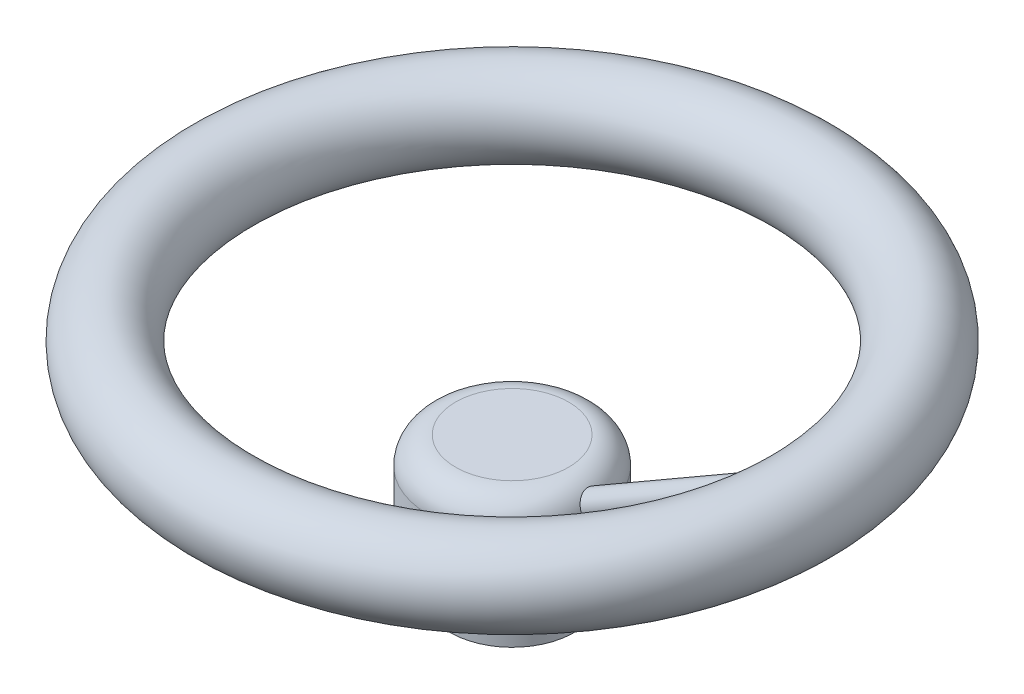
ISO-10303-21;
HEADER;
FILE_DESCRIPTION(('STEP AP214'),'2;1');
FILE_NAME('part.step','',(''),(''),'','','');
FILE_SCHEMA(('AUTOMOTIVE_DESIGN { 1 0 10303 214 1 1 1 1 }'));
ENDSEC;
DATA;
#1=APPLICATION_CONTEXT('core data for automotive mechanical design processes');
#2=APPLICATION_PROTOCOL_DEFINITION('international standard','automotive_design',2000,#1);
#3=PRODUCT_CONTEXT('',#1,'mechanical');
#4=PRODUCT('Part','Part','',(#3));
#5=PRODUCT_RELATED_PRODUCT_CATEGORY('part','',(#4));
#6=PRODUCT_DEFINITION_FORMATION('','',#4);
#7=PRODUCT_DEFINITION_CONTEXT('part definition',#1,'design');
#8=PRODUCT_DEFINITION('design','',#6,#7);
#9=PRODUCT_DEFINITION_SHAPE('','',#8);
#10=(LENGTH_UNIT() NAMED_UNIT(*) SI_UNIT(.MILLI.,.METRE.));
#11=(NAMED_UNIT(*) PLANE_ANGLE_UNIT() SI_UNIT($,.RADIAN.));
#12=(NAMED_UNIT(*) SI_UNIT($,.STERADIAN.) SOLID_ANGLE_UNIT());
#13=UNCERTAINTY_MEASURE_WITH_UNIT(LENGTH_MEASURE(1.E-05),#10,'distance_accuracy_value','');
#14=(GEOMETRIC_REPRESENTATION_CONTEXT(3) GLOBAL_UNCERTAINTY_ASSIGNED_CONTEXT((#13)) GLOBAL_UNIT_ASSIGNED_CONTEXT((#10,
#11,#12)) REPRESENTATION_CONTEXT('',''));
#15=CARTESIAN_POINT('',(0.,0.,0.));
#16=DIRECTION('',(0.,0.,1.));
#17=DIRECTION('',(1.,0.,0.));
#18=AXIS2_PLACEMENT_3D('',#15,#16,#17);
#19=CARTESIAN_POINT('',(0.,-5.72295049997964,0.));
#20=DIRECTION('',(0.,1.,0.));
#21=DIRECTION('',(-1.,0.,0.));
#22=AXIS2_PLACEMENT_3D('',#19,#20,#21);
#23=TOROIDAL_SURFACE('',#22,11.8621252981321,5.72295049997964);
#24=CARTESIAN_POINT('',(0.,0.,0.));
#25=DIRECTION('',(0.,1.,0.));
#26=DIRECTION('',(-1.,0.,0.));
#27=AXIS2_PLACEMENT_3D('',#24,#25,#26);
#28=CIRCLE('',#27,11.8621252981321);
#29=CARTESIAN_POINT('',(-11.8621252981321,0.,0.));
#30=VERTEX_POINT('',#29);
#31=EDGE_CURVE('E47',#30,#30,#28,.T.);
#32=ORIENTED_EDGE('',*,*,#31,.F.);
#33=EDGE_LOOP('',(#32));
#34=FACE_BOUND('',#33,.T.);
#35=CARTESIAN_POINT('',(17.454672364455,-5.72315049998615,-2.13759288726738));
#36=CARTESIAN_POINT('',(17.4489443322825,-5.65549358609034,-2.1844372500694));
#37=CARTESIAN_POINT('',(17.4421255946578,-5.58610462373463,-2.22865139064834));
#38=CARTESIAN_POINT('',(17.4261352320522,-5.44433118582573,-2.31155173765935));
#39=CARTESIAN_POINT('',(17.4169628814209,-5.37194579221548,-2.35023623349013));
#40=CARTESIAN_POINT('',(17.3960625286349,-5.22444616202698,-2.42189922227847));
#41=CARTESIAN_POINT('',(17.3843261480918,-5.14932366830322,-2.45485835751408));
#42=CARTESIAN_POINT('',(17.3582160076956,-4.99714078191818,-2.51460497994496));
#43=CARTESIAN_POINT('',(17.3438424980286,-4.92008057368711,-2.54139305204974));
#44=CARTESIAN_POINT('',(17.2965661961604,-4.68640300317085,-2.61215433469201));
#45=CARTESIAN_POINT('',(17.2595383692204,-4.52751275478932,-2.64641535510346));
#46=CARTESIAN_POINT('',(17.1748527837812,-4.20927392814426,-2.68662768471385));
#47=CARTESIAN_POINT('',(17.1272135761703,-4.04992662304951,-2.69262799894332));
#48=CARTESIAN_POINT('',(17.0261002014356,-3.74612950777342,-2.67562133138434));
#49=CARTESIAN_POINT('',(16.9732061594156,-3.60138439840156,-2.65447347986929));
#50=CARTESIAN_POINT('',(16.8614942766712,-3.32052893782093,-2.58616604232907));
#51=CARTESIAN_POINT('',(16.8026763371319,-3.18441873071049,-2.53900602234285));
#52=CARTESIAN_POINT('',(16.6858055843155,-2.93290351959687,-2.42339574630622));
#53=CARTESIAN_POINT('',(16.6279222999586,-2.81674369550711,-2.35640842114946));
#54=CARTESIAN_POINT('',(16.5125621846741,-2.59849870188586,-2.20225148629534));
#55=CARTESIAN_POINT('',(16.4550853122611,-2.49641207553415,-2.11508396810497));
#56=CARTESIAN_POINT('',(16.3436385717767,-2.30817353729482,-1.92287470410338));
#57=CARTESIAN_POINT('',(16.2896731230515,-2.22204146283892,-1.81781101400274));
#58=CARTESIAN_POINT('',(16.188496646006,-2.06710417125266,-1.59270960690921));
#59=CARTESIAN_POINT('',(16.1412869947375,-1.998302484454,-1.47266884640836));
#60=CARTESIAN_POINT('',(16.0553394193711,-1.87695258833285,-1.21692101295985));
#61=CARTESIAN_POINT('',(16.0169004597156,-1.82495809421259,-1.08085025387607));
#62=CARTESIAN_POINT('',(15.953182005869,-1.74056437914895,-0.799840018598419));
#63=CARTESIAN_POINT('',(15.9279022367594,-1.70816474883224,-0.654900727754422));
#64=CARTESIAN_POINT('',(15.8923768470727,-1.66301395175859,-0.359166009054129));
#65=CARTESIAN_POINT('',(15.8822340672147,-1.65039716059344,-0.208337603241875));
#66=CARTESIAN_POINT('',(15.8781676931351,-1.64531311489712,0.0938707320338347));
#67=CARTESIAN_POINT('',(15.8842432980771,-1.65284486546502,0.245250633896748));
#68=CARTESIAN_POINT('',(15.91194724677,-1.68782413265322,0.542607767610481));
#69=CARTESIAN_POINT('',(15.9334125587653,-1.71506290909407,0.688624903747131));
#70=CARTESIAN_POINT('',(15.9900048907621,-1.78905576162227,0.972868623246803));
#71=CARTESIAN_POINT('',(16.0251336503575,-1.83581232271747,1.11109421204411));
#72=CARTESIAN_POINT('',(16.1068043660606,-1.94897954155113,1.37713227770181));
#73=CARTESIAN_POINT('',(16.1534414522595,-2.01555502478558,1.50484548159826));
#74=CARTESIAN_POINT('',(16.2547451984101,-2.16752435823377,1.74498943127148));
#75=CARTESIAN_POINT('',(16.3094116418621,-2.25291770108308,1.85742058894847));
#76=CARTESIAN_POINT('',(16.4232276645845,-2.44120753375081,2.06369481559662));
#77=CARTESIAN_POINT('',(16.4823736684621,-2.5440901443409,2.15755249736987));
#78=CARTESIAN_POINT('',(16.6016318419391,-2.76534462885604,2.32397034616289));
#79=CARTESIAN_POINT('',(16.6617437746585,-2.8837127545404,2.39653565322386));
#80=CARTESIAN_POINT('',(16.7778760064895,-3.12933182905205,2.51650191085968));
#81=CARTESIAN_POINT('',(16.8339645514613,-3.25622181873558,2.56457665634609));
#82=CARTESIAN_POINT('',(16.9412919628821,-3.51839000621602,2.63764148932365));
#83=CARTESIAN_POINT('',(16.9925314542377,-3.65366711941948,2.66263455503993));
#84=CARTESIAN_POINT('',(17.0877411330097,-3.92751459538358,2.6893338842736));
#85=CARTESIAN_POINT('',(17.1317750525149,-4.06604211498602,2.69125657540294));
#86=CARTESIAN_POINT('',(17.2119883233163,-4.34395361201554,2.67312900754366));
#87=CARTESIAN_POINT('',(17.2481640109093,-4.48333795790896,2.65306852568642));
#88=CARTESIAN_POINT('',(17.3136970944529,-4.76603806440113,2.59084193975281));
#89=CARTESIAN_POINT('',(17.3426463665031,-4.90922368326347,2.54766589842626));
#90=CARTESIAN_POINT('',(17.3915545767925,-5.18907606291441,2.44047475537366));
#91=CARTESIAN_POINT('',(17.411520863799,-5.32574807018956,2.3764767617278));
#92=CARTESIAN_POINT('',(17.4328873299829,-5.50304115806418,2.27767597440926));
#93=CARTESIAN_POINT('',(17.4378890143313,-5.54801365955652,2.25115847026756));
#94=CARTESIAN_POINT('',(17.4469607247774,-5.63659945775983,2.19597816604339));
#95=CARTESIAN_POINT('',(17.4510325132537,-5.68021518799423,2.16731956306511));
#96=CARTESIAN_POINT('',(17.4546723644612,-5.72315049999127,2.13759288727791));
#97=B_SPLINE_CURVE_WITH_KNOTS('',3,(#35,#36,#37,#38,#39,#40,#41,#42,#43,#44,#45,#46,#47,#48,#49,
#50,#51,#52,#53,#54,#55,#56,#57,#58,#59,#60,#61,#62,#63,#64,#65,#66,#67,#68,#69,#70,#71,#72,#73,
#74,#75,#76,#77,#78,#79,#80,#81,#82,#83,#84,#85,#86,#87,#88,#89,#90,#91,#92,#93,#94,#95,#96),
.UNSPECIFIED.,.F.,.F.,(4,2,2,2,2,2,2,2,2,2,2,2,2,2,2,2,2,2,2,2,2,2,2,2,2,2,2,2,2,2,4),(0.,
0.247406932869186,0.494890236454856,0.743194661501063,0.99147554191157,1.48878107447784,
1.98522394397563,2.44941548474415,2.91361476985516,3.34969124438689,3.78572254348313,
4.22229240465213,4.65895112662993,5.10879930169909,5.55863807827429,6.01151936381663,
6.4643782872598,6.91250939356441,7.3606975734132,7.81272254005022,8.2647353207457,
8.71639105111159,9.16793766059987,9.6062803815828,10.0445665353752,10.4787377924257,
10.9131110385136,11.3682284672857,11.822972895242,11.9802645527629,12.1372555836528),.UNSPECIFIED.);
#98=CARTESIAN_POINT('',(17.4546554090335,-5.72295049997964,-2.13773136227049));
#99=VERTEX_POINT('',#98);
#100=CARTESIAN_POINT('',(17.4546554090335,-5.72295049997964,2.13773136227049));
#101=VERTEX_POINT('',#100);
#102=EDGE_CURVE('E60',#99,#101,#97,.T.);
#103=ORIENTED_EDGE('',*,*,#102,.F.);
#104=CARTESIAN_POINT('',(0.,-5.72295049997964,0.));
#105=DIRECTION('',(0.,1.,0.));
#106=DIRECTION('',(-1.,0.,0.));
#107=AXIS2_PLACEMENT_3D('',#104,#105,#106);
#108=CIRCLE('',#107,17.5850757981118);
#109=EDGE_CURVE('E53',#99,#101,#108,.T.);
#110=ORIENTED_EDGE('',*,*,#109,.T.);
#111=EDGE_LOOP('',(#103,#110));
#112=FACE_BOUND('',#111,.T.);
#113=ADVANCED_FACE('F34',(#34,#112),#23,.T.);
#114=CARTESIAN_POINT('',(0.,0.,0.));
#115=DIRECTION('',(0.,1.,0.));
#116=DIRECTION('',(-1.,0.,0.));
#117=AXIS2_PLACEMENT_3D('',#114,#115,#116);
#118=CYLINDRICAL_SURFACE('',#117,17.5850757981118);
#119=CARTESIAN_POINT('',(0.,-12.382969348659,0.));
#120=DIRECTION('',(0.,1.,0.));
#121=DIRECTION('',(-1.,0.,0.));
#122=AXIS2_PLACEMENT_3D('',#119,#120,#121);
#123=CIRCLE('',#122,17.5850757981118);
#124=CARTESIAN_POINT('',(-17.5850757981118,-12.382969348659,0.));
#125=VERTEX_POINT('',#124);
#126=EDGE_CURVE('E58',#125,#125,#123,.T.);
#127=ORIENTED_EDGE('',*,*,#126,.T.);
#128=EDGE_LOOP('',(#127));
#129=FACE_BOUND('',#128,.T.);
#130=CARTESIAN_POINT('',(17.4546554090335,-5.72295049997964,2.13773136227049));
#131=CARTESIAN_POINT('',(17.4599144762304,-5.78499951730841,2.09478373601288));
#132=CARTESIAN_POINT('',(17.4653166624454,-5.8453382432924,2.04936788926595));
#133=CARTESIAN_POINT('',(17.4762669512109,-5.96215247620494,1.95379309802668));
#134=CARTESIAN_POINT('',(17.4818151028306,-6.01862666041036,1.90363254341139));
#135=CARTESIAN_POINT('',(17.4929226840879,-6.12731884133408,1.79870185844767));
#136=CARTESIAN_POINT('',(17.4984821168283,-6.17952941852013,1.74392401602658));
#137=CARTESIAN_POINT('',(17.5094471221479,-6.27911779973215,1.63016159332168));
#138=CARTESIAN_POINT('',(17.5148527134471,-6.32649619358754,1.5711775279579));
#139=CARTESIAN_POINT('',(17.5306319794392,-6.46096205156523,1.38809182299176));
#140=CARTESIAN_POINT('',(17.5405498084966,-6.54020746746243,1.25802263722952));
#141=CARTESIAN_POINT('',(17.5579384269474,-6.67445833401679,0.986011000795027));
#142=CARTESIAN_POINT('',(17.5654121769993,-6.72949314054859,0.84408317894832));
#143=CARTESIAN_POINT('',(17.5767322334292,-6.81145120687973,0.559232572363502));
#144=CARTESIAN_POINT('',(17.580729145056,-6.83954767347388,0.416653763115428));
#145=CARTESIAN_POINT('',(17.5851942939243,-6.87087876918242,0.128682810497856));
#146=CARTESIAN_POINT('',(17.5856615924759,-6.8741067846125,-0.0167100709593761));
#147=CARTESIAN_POINT('',(17.5830489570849,-6.85583785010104,-0.301688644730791));
#148=CARTESIAN_POINT('',(17.5800704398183,-6.83504781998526,-0.441321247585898));
#149=CARTESIAN_POINT('',(17.5710656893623,-6.7706201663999,-0.715048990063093));
#150=CARTESIAN_POINT('',(17.5650405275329,-6.7269905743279,-0.849146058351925));
#151=CARTESIAN_POINT('',(17.5505692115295,-6.6181335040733,-1.10879073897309));
#152=CARTESIAN_POINT('',(17.5421125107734,-6.55281174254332,-1.23429809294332));
#153=CARTESIAN_POINT('',(17.5236802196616,-6.40273653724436,-1.47305183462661));
#154=CARTESIAN_POINT('',(17.5137039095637,-6.31797387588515,-1.58629236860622));
#155=CARTESIAN_POINT('',(17.4953272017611,-6.15071227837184,-1.77640791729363));
#156=CARTESIAN_POINT('',(17.4870182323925,-6.07124971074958,-1.85599772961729));
#157=CARTESIAN_POINT('',(17.4705842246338,-5.90342535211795,-2.00477860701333));
#158=CARTESIAN_POINT('',(17.4624588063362,-5.81508450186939,-2.0739932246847));
#159=CARTESIAN_POINT('',(17.4546554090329,-5.72295049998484,-2.13773136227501));
#160=B_SPLINE_CURVE_WITH_KNOTS('',3,(#130,#131,#132,#133,#134,#135,#136,#137,#138,#139,#140,
#141,#142,#143,#144,#145,#146,#147,#148,#149,#150,#151,#152,#153,#154,#155,#156,#157,#158,#159),
.UNSPECIFIED.,.F.,.F.,(4,2,2,2,2,2,2,2,2,2,2,2,2,2,4),(0.,0.226888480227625,0.453854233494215,
0.681206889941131,0.90853176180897,1.36389287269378,1.81870031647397,2.25265507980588,
2.68672524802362,3.10833809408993,3.52980278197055,3.95312384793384,4.37664604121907,
4.71415476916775,5.05088532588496),.UNSPECIFIED.);
#161=EDGE_CURVE('E11',#101,#99,#160,.T.);
#162=ORIENTED_EDGE('',*,*,#161,.F.);
#163=ORIENTED_EDGE('',*,*,#109,.F.);
#164=EDGE_LOOP('',(#162,#163));
#165=FACE_BOUND('',#164,.T.);
#166=ADVANCED_FACE('F55',(#129,#165),#118,.T.);
#167=CARTESIAN_POINT('',(0.,0.,0.));
#168=DIRECTION('',(0.,-1.,0.));
#169=DIRECTION('',(1.,0.,0.));
#170=AXIS2_PLACEMENT_3D('',#167,#168,#169);
#171=PLANE('',#170);
#172=ORIENTED_EDGE('',*,*,#31,.T.);
#173=EDGE_LOOP('',(#172));
#174=FACE_BOUND('',#173,.T.);
#175=ADVANCED_FACE('F36',(#174),#171,.F.);
#176=CARTESIAN_POINT('',(17.5850757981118,-12.382969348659,0.));
#177=DIRECTION('',(0.,1.,0.));
#178=DIRECTION('',(-1.,0.,0.));
#179=AXIS2_PLACEMENT_3D('',#176,#177,#178);
#180=PLANE('',#179);
#181=ORIENTED_EDGE('',*,*,#126,.F.);
#182=EDGE_LOOP('',(#181));
#183=FACE_BOUND('',#182,.T.);
#184=CARTESIAN_POINT('',(0.,-12.382969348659,0.));
#185=DIRECTION('',(0.,1.,0.));
#186=DIRECTION('',(-1.,0.,0.));
#187=AXIS2_PLACEMENT_3D('',#184,#185,#186);
#188=CIRCLE('',#187,13.0620975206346);
#189=CARTESIAN_POINT('',(-13.0620975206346,-12.382969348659,0.));
#190=VERTEX_POINT('',#189);
#191=EDGE_CURVE('E101',#190,#190,#188,.T.);
#192=ORIENTED_EDGE('',*,*,#191,.T.);
#193=EDGE_LOOP('',(#192));
#194=FACE_BOUND('',#193,.T.);
#195=ADVANCED_FACE('F108',(#183,#194),#180,.F.);
#196=CARTESIAN_POINT('',(0.,0.,0.));
#197=DIRECTION('',(0.,1.,0.));
#198=DIRECTION('',(-1.,0.,0.));
#199=AXIS2_PLACEMENT_3D('',#196,#197,#198);
#200=CYLINDRICAL_SURFACE('',#199,13.0620975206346);
#201=ORIENTED_EDGE('',*,*,#191,.F.);
#202=EDGE_LOOP('',(#201));
#203=FACE_BOUND('',#202,.T.);
#204=CARTESIAN_POINT('',(0.,-29.4270498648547,0.));
#205=DIRECTION('',(0.,1.,0.));
#206=DIRECTION('',(-1.,0.,0.));
#207=AXIS2_PLACEMENT_3D('',#204,#205,#206);
#208=CIRCLE('',#207,13.0620975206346);
#209=CARTESIAN_POINT('',(-13.0620975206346,-29.4270498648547,0.));
#210=VERTEX_POINT('',#209);
#211=EDGE_CURVE('E62',#210,#210,#208,.T.);
#212=ORIENTED_EDGE('',*,*,#211,.T.);
#213=EDGE_LOOP('',(#212));
#214=FACE_BOUND('',#213,.T.);
#215=ADVANCED_FACE('F76',(#203,#214),#200,.T.);
#216=CARTESIAN_POINT('',(13.0620975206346,-29.4270498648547,0.));
#217=DIRECTION('',(0.,1.,0.));
#218=DIRECTION('',(-1.,0.,0.));
#219=AXIS2_PLACEMENT_3D('',#216,#217,#218);
#220=PLANE('',#219);
#221=ORIENTED_EDGE('',*,*,#211,.F.);
#222=EDGE_LOOP('',(#221));
#223=FACE_BOUND('',#222,.T.);
#224=ADVANCED_FACE('F68',(#223),#220,.F.);
#225=CARTESIAN_POINT('',(500001.343890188,288661.99131905,0.));
#226=DIRECTION('',(-0.866025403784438,-0.500000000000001,0.));
#227=DIRECTION('',(0.500000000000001,-0.866025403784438,0.));
#228=AXIS2_PLACEMENT_3D('',#225,#226,#227);
#229=CYLINDRICAL_SURFACE('',#228,2.68778037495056);
#230=CARTESIAN_POINT('',(52.5384669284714,13.3592910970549,-0.475462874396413));
#231=CARTESIAN_POINT('',(52.5260995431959,13.3827557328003,-0.622896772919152));
#232=CARTESIAN_POINT('',(52.5080438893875,13.4172527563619,-0.768301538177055));
#233=CARTESIAN_POINT('',(52.4619684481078,13.5079075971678,-1.0507705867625));
#234=CARTESIAN_POINT('',(52.4339274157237,13.5641116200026,-1.18781635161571));
#235=CARTESIAN_POINT('',(52.3701512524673,13.6973668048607,-1.4494116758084));
#236=CARTESIAN_POINT('',(52.3344181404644,13.7744124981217,-1.57396450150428));
#237=CARTESIAN_POINT('',(52.2581777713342,13.9479818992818,-1.80689344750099));
#238=CARTESIAN_POINT('',(52.2176733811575,14.0444939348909,-1.91527919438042));
#239=CARTESIAN_POINT('',(52.1356601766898,14.2537666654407,-2.11167301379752));
#240=CARTESIAN_POINT('',(52.0941685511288,14.3663250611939,-2.19990368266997));
#241=CARTESIAN_POINT('',(52.013002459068,14.6057406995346,-2.35525378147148));
#242=CARTESIAN_POINT('',(51.9733278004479,14.7325964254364,-2.42237544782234));
#243=CARTESIAN_POINT('',(51.8992886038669,14.9951385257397,-2.53336257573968));
#244=CARTESIAN_POINT('',(51.8648542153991,15.1306665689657,-2.57755727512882));
#245=CARTESIAN_POINT('',(51.802746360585,15.4084485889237,-2.64401361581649));
#246=CARTESIAN_POINT('',(51.7750738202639,15.5507034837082,-2.66627225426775));
#247=CARTESIAN_POINT('',(51.7269719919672,15.843131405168,-2.69004631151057));
#248=CARTESIAN_POINT('',(51.706823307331,15.9934087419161,-2.69082501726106));
#249=CARTESIAN_POINT('',(51.6755934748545,16.2934964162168,-2.67137384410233));
#250=CARTESIAN_POINT('',(51.6645152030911,16.4433065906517,-2.65113730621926));
#251=CARTESIAN_POINT('',(51.6503562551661,16.7557964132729,-2.58821079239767));
#252=CARTESIAN_POINT('',(51.6482943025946,16.9180694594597,-2.54328728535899));
#253=CARTESIAN_POINT('',(51.6536932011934,17.2350437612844,-2.43212120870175));
#254=CARTESIAN_POINT('',(51.6611635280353,17.3897373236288,-2.36585747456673));
#255=CARTESIAN_POINT('',(51.6854606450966,17.7101821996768,-2.20275523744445));
#256=CARTESIAN_POINT('',(51.7034828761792,17.8743040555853,-2.10288321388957));
#257=CARTESIAN_POINT('',(51.7461890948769,18.1841787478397,-1.87884642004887));
#258=CARTESIAN_POINT('',(51.7708713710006,18.3299362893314,-1.7546878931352));
#259=CARTESIAN_POINT('',(51.8161846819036,18.5648354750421,-1.51503485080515));
#260=CARTESIAN_POINT('',(51.8363743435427,18.659182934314,-1.40456001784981));
#261=CARTESIAN_POINT('',(51.8753527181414,18.8294267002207,-1.16998718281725));
#262=CARTESIAN_POINT('',(51.8941439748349,18.905357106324,-1.0459149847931));
#263=CARTESIAN_POINT('',(51.9236428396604,19.0196811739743,-0.813377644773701));
#264=CARTESIAN_POINT('',(51.9352198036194,19.0626338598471,-0.707280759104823));
#265=CARTESIAN_POINT('',(51.9539808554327,19.1309424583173,-0.489181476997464));
#266=CARTESIAN_POINT('',(51.9611696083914,19.1563170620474,-0.377185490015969));
#267=CARTESIAN_POINT('',(51.9699854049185,19.1873110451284,-0.149568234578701));
#268=CARTESIAN_POINT('',(51.9715810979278,19.192819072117,-0.0339301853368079));
#269=CARTESIAN_POINT('',(51.9688198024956,19.1831839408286,0.196410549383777));
#270=CARTESIAN_POINT('',(51.9644618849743,19.1680375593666,0.311113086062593));
#271=CARTESIAN_POINT('',(51.9511501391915,19.1206144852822,0.526869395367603));
#272=CARTESIAN_POINT('',(51.9425921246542,19.0898060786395,0.628280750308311));
#273=CARTESIAN_POINT('',(51.9222572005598,19.0141614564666,0.825341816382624));
#274=CARTESIAN_POINT('',(51.9104785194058,18.9693175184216,0.920988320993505));
#275=CARTESIAN_POINT('',(51.8787403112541,18.843083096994,1.15059372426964));
#276=CARTESIAN_POINT('',(51.8575944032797,18.7545390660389,1.28045733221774));
#277=CARTESIAN_POINT('',(51.8147573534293,18.5577109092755,1.52422585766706));
#278=CARTESIAN_POINT('',(51.7930649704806,18.4493775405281,1.63808968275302));
#279=CARTESIAN_POINT('',(51.7469157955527,18.1876938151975,1.8768129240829));
#280=CARTESIAN_POINT('',(51.7231805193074,18.0299283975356,1.99698210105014));
#281=CARTESIAN_POINT('',(51.6842344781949,17.6966019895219,2.21099204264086));
#282=CARTESIAN_POINT('',(51.6690263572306,17.5210354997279,2.30482463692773));
#283=CARTESIAN_POINT('',(51.6506300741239,17.1558509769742,2.46450562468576));
#284=CARTESIAN_POINT('',(51.6474934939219,16.9661761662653,2.53023286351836));
#285=CARTESIAN_POINT('',(51.653829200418,16.6759167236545,2.60464050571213));
#286=CARTESIAN_POINT('',(51.6577839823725,16.578176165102,2.62541506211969));
#287=CARTESIAN_POINT('',(51.6695530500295,16.381507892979,2.65839020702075));
#288=CARTESIAN_POINT('',(51.6773649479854,16.2825809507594,2.67059608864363));
#289=CARTESIAN_POINT('',(51.6962844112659,16.0909644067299,2.68540451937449));
#290=CARTESIAN_POINT('',(51.7071400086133,15.9982947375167,2.68858850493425));
#291=CARTESIAN_POINT('',(51.7322298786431,15.8135457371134,2.68662486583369));
#292=CARTESIAN_POINT('',(51.7464621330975,15.7214660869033,2.68148220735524));
#293=CARTESIAN_POINT('',(51.7781201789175,15.5388060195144,2.66254616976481));
#294=CARTESIAN_POINT('',(51.7955437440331,15.4482246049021,2.64875880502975));
#295=CARTESIAN_POINT('',(51.8332488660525,15.2695022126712,2.61234998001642));
#296=CARTESIAN_POINT('',(51.8535299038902,15.1813607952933,2.58973012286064));
#297=CARTESIAN_POINT('',(51.9115597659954,14.9479115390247,2.51657789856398));
#298=CARTESIAN_POINT('',(51.9516095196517,14.8057086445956,2.45758667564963));
#299=CARTESIAN_POINT('',(52.0355134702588,14.535818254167,2.31465429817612));
#300=CARTESIAN_POINT('',(52.0793662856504,14.4081255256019,2.23072217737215));
#301=CARTESIAN_POINT('',(52.1638470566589,14.1795707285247,2.0471627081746));
#302=CARTESIAN_POINT('',(52.2044777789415,14.0774332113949,1.94911917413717));
#303=CARTESIAN_POINT('',(52.2825479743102,13.8910291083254,1.73624850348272));
#304=CARTESIAN_POINT('',(52.3199878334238,13.8067603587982,1.62142340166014));
#305=CARTESIAN_POINT('',(52.3889239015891,13.6572584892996,1.37762520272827));
#306=CARTESIAN_POINT('',(52.4203920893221,13.5921143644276,1.24858968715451));
#307=CARTESIAN_POINT('',(52.474734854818,13.4823287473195,0.980302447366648));
#308=CARTESIAN_POINT('',(52.4976046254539,13.4376987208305,0.841045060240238));
#309=CARTESIAN_POINT('',(52.5332877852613,13.3689266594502,0.553523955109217));
#310=CARTESIAN_POINT('',(52.5459036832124,13.3451862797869,0.405140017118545));
#311=CARTESIAN_POINT('',(52.5593090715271,13.3199751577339,0.106176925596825));
#312=CARTESIAN_POINT('',(52.5601231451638,13.3184581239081,-0.0443970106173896));
#313=CARTESIAN_POINT('',(52.553440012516,13.3310142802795,-0.241079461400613));
#314=CARTESIAN_POINT('',(52.5512476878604,13.3351319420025,-0.288183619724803));
#315=CARTESIAN_POINT('',(52.5457152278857,13.3455628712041,-0.382080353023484));
#316=CARTESIAN_POINT('',(52.5423750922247,13.3518761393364,-0.428872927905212));
#317=CARTESIAN_POINT('',(52.5384669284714,13.3592910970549,-0.475462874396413));
#318=B_SPLINE_CURVE_WITH_KNOTS('',3,(#230,#231,#232,#233,#234,#235,#236,#237,#238,#239,#240,
#241,#242,#243,#244,#245,#246,#247,#248,#249,#250,#251,#252,#253,#254,#255,#256,#257,#258,#259,
#260,#261,#262,#263,#264,#265,#266,#267,#268,#269,#270,#271,#272,#273,#274,#275,#276,#277,#278,
#279,#280,#281,#282,#283,#284,#285,#286,#287,#288,#289,#290,#291,#292,#293,#294,#295,#296,#297,
#298,#299,#300,#301,#302,#303,#304,#305,#306,#307,#308,#309,#310,#311,#312,#313,#314,#315,#316,
#317),.UNSPECIFIED.,.T.,.F.,(4,2,2,2,2,2,2,2,2,2,2,2,2,2,2,2,2,2,2,2,2,2,2,2,2,2,2,2,2,2,2,2,2,
2,2,2,2,2,2,2,2,2,2,4),(0.,0.449224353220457,0.899410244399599,1.34947812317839,
1.79927693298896,2.24383793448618,2.68835182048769,3.12629216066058,3.56429244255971,
4.01729712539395,4.47044539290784,4.9736544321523,5.47736408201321,6.05381878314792,
6.63012548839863,7.06871397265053,7.50648409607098,7.85026673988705,8.193683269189,
8.53902168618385,8.88441400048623,9.20215860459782,9.52007834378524,9.99322431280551,
10.4675640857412,11.063764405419,11.660149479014,12.2590801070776,12.5587214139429,
12.8581774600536,13.1378399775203,13.4173357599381,13.6966373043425,13.9758881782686,
14.4503281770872,14.9245965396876,15.3643997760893,15.804149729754,16.2459147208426,
16.6879263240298,17.1382618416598,17.5876591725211,17.7296165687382,17.871574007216),.UNSPECIFIED.);
#319=CARTESIAN_POINT('',(52.5384669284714,13.3592910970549,-0.475462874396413));
#320=VERTEX_POINT('',#319);
#321=EDGE_CURVE('E63',#320,#320,#318,.T.);
#322=ORIENTED_EDGE('',*,*,#321,.F.);
#323=EDGE_LOOP('',(#322));
#324=FACE_BOUND('',#323,.T.);
#325=ORIENTED_EDGE('',*,*,#161,.T.);
#326=ORIENTED_EDGE('',*,*,#102,.T.);
#327=EDGE_LOOP('',(#325,#326));
#328=FACE_BOUND('',#327,.T.);
#329=ADVANCED_FACE('F65',(#324,#328),#229,.T.);
#330=CARTESIAN_POINT('',(0.,17.0750983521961,0.));
#331=DIRECTION('',(0.,1.,0.));
#332=DIRECTION('',(-1.,0.,0.));
#333=AXIS2_PLACEMENT_3D('',#330,#331,#332);
#334=TOROIDAL_SURFACE('',#333,60.4458481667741,8.73498068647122);
#335=ORIENTED_EDGE('',*,*,#321,.T.);
#336=EDGE_LOOP('',(#335));
#337=FACE_BOUND('',#336,.T.);
#338=ADVANCED_FACE('F67',(#337),#334,.T.);
#339=CLOSED_SHELL('',(#113,#166,#175,#195,#215,#224,#329,#338));
#340=MANIFOLD_SOLID_BREP('B2',#339);
#341=ADVANCED_BREP_SHAPE_REPRESENTATION('',(#18,#340),#14);
#342=SHAPE_DEFINITION_REPRESENTATION(#9,#341);
ENDSEC;
END-ISO-10303-21;
